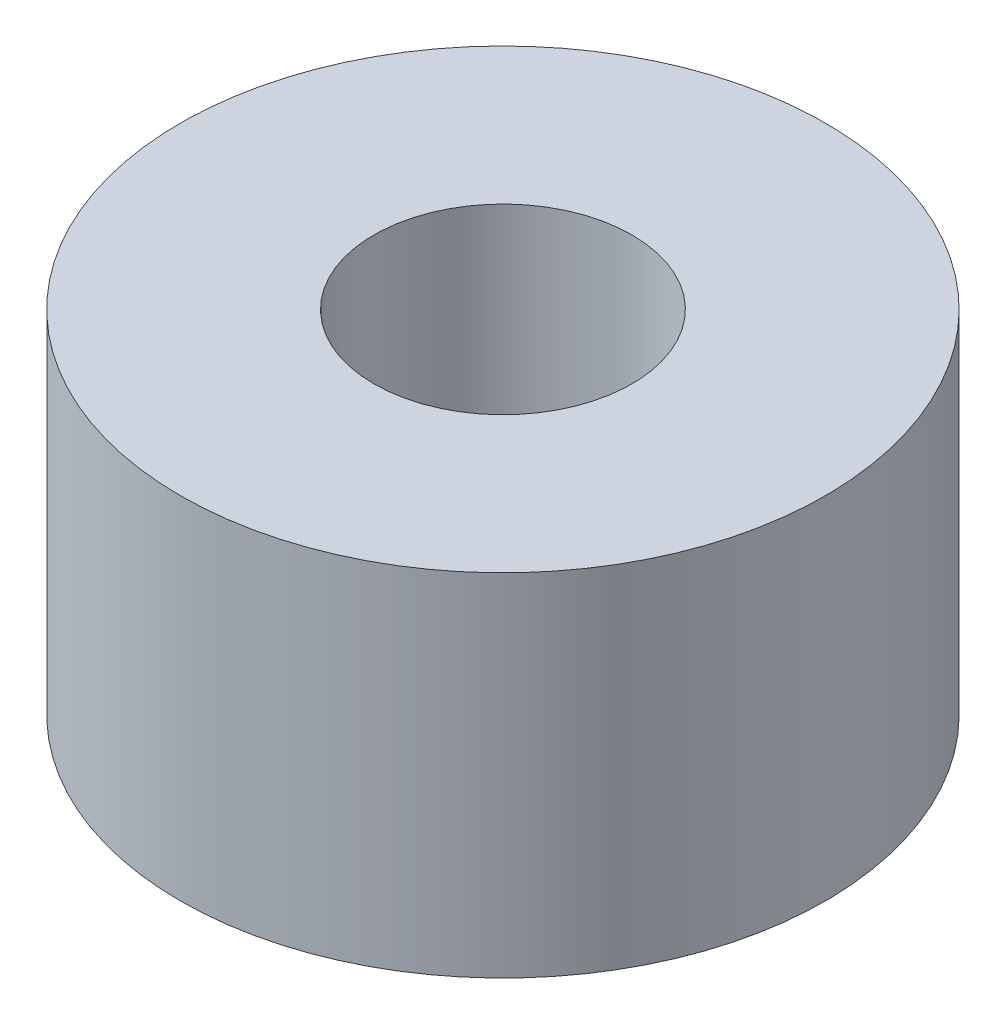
ISO-10303-21;
HEADER;
FILE_DESCRIPTION(('STEP AP214'),'2;1');
FILE_NAME('part.step','',(''),(''),'','','');
FILE_SCHEMA(('AUTOMOTIVE_DESIGN { 1 0 10303 214 1 1 1 1 }'));
ENDSEC;
DATA;
#1=APPLICATION_CONTEXT('core data for automotive mechanical design processes');
#2=APPLICATION_PROTOCOL_DEFINITION('international standard','automotive_design',2000,#1);
#3=PRODUCT_CONTEXT('',#1,'mechanical');
#4=PRODUCT('Part','Part','',(#3));
#5=PRODUCT_RELATED_PRODUCT_CATEGORY('part','',(#4));
#6=PRODUCT_DEFINITION_FORMATION('','',#4);
#7=PRODUCT_DEFINITION_CONTEXT('part definition',#1,'design');
#8=PRODUCT_DEFINITION('design','',#6,#7);
#9=PRODUCT_DEFINITION_SHAPE('','',#8);
#10=(LENGTH_UNIT() NAMED_UNIT(*) SI_UNIT(.MILLI.,.METRE.));
#11=(NAMED_UNIT(*) PLANE_ANGLE_UNIT() SI_UNIT($,.RADIAN.));
#12=(NAMED_UNIT(*) SI_UNIT($,.STERADIAN.) SOLID_ANGLE_UNIT());
#13=UNCERTAINTY_MEASURE_WITH_UNIT(LENGTH_MEASURE(1.E-05),#10,'distance_accuracy_value','');
#14=(GEOMETRIC_REPRESENTATION_CONTEXT(3) GLOBAL_UNCERTAINTY_ASSIGNED_CONTEXT((#13)) GLOBAL_UNIT_ASSIGNED_CONTEXT((#10,
#11,#12)) REPRESENTATION_CONTEXT('',''));
#15=CARTESIAN_POINT('',(0.,0.,0.));
#16=DIRECTION('',(0.,0.,1.));
#17=DIRECTION('',(1.,0.,0.));
#18=AXIS2_PLACEMENT_3D('',#15,#16,#17);
#19=CARTESIAN_POINT('',(0.,8.636,0.));
#20=DIRECTION('',(0.,1.,0.));
#21=DIRECTION('',(0.,0.,1.));
#22=AXIS2_PLACEMENT_3D('',#19,#20,#21);
#23=PLANE('',#22);
#24=CARTESIAN_POINT('',(0.,8.636,0.));
#25=DIRECTION('',(0.,1.,0.));
#26=DIRECTION('',(0.,0.,1.));
#27=AXIS2_PLACEMENT_3D('',#24,#25,#26);
#28=CIRCLE('',#27,7.9375);
#29=CARTESIAN_POINT('',(0.,8.636,7.9375));
#30=VERTEX_POINT('',#29);
#31=EDGE_CURVE('E10',#30,#30,#28,.T.);
#32=ORIENTED_EDGE('',*,*,#31,.T.);
#33=EDGE_LOOP('',(#32));
#34=FACE_BOUND('',#33,.T.);
#35=CARTESIAN_POINT('',(0.,8.636,0.));
#36=DIRECTION('',(0.,1.,0.));
#37=DIRECTION('',(0.,0.,1.));
#38=AXIS2_PLACEMENT_3D('',#35,#36,#37);
#39=CIRCLE('',#38,3.175);
#40=CARTESIAN_POINT('',(0.,8.636,3.175));
#41=VERTEX_POINT('',#40);
#42=EDGE_CURVE('E41',#41,#41,#39,.T.);
#43=ORIENTED_EDGE('',*,*,#42,.F.);
#44=EDGE_LOOP('',(#43));
#45=FACE_BOUND('',#44,.T.);
#46=ADVANCED_FACE('F30',(#34,#45),#23,.T.);
#47=CARTESIAN_POINT('',(0.,0.,0.));
#48=DIRECTION('',(0.,1.,0.));
#49=DIRECTION('',(0.,0.,1.));
#50=AXIS2_PLACEMENT_3D('',#47,#48,#49);
#51=PLANE('',#50);
#52=CARTESIAN_POINT('',(0.,0.,0.));
#53=DIRECTION('',(0.,1.,0.));
#54=DIRECTION('',(0.,0.,1.));
#55=AXIS2_PLACEMENT_3D('',#52,#53,#54);
#56=CIRCLE('',#55,7.9375);
#57=CARTESIAN_POINT('',(0.,0.,7.9375));
#58=VERTEX_POINT('',#57);
#59=EDGE_CURVE('E34',#58,#58,#56,.T.);
#60=ORIENTED_EDGE('',*,*,#59,.F.);
#61=EDGE_LOOP('',(#60));
#62=FACE_BOUND('',#61,.T.);
#63=CARTESIAN_POINT('',(0.,0.,0.));
#64=DIRECTION('',(0.,1.,0.));
#65=DIRECTION('',(0.,0.,1.));
#66=AXIS2_PLACEMENT_3D('',#63,#64,#65);
#67=CIRCLE('',#66,3.175);
#68=CARTESIAN_POINT('',(0.,0.,3.175));
#69=VERTEX_POINT('',#68);
#70=EDGE_CURVE('E43',#69,#69,#67,.T.);
#71=ORIENTED_EDGE('',*,*,#70,.T.);
#72=EDGE_LOOP('',(#71));
#73=FACE_BOUND('',#72,.T.);
#74=ADVANCED_FACE('F53',(#62,#73),#51,.F.);
#75=CARTESIAN_POINT('',(0.,8.636,0.));
#76=DIRECTION('',(0.,-1.,0.));
#77=DIRECTION('',(0.,0.,-1.));
#78=AXIS2_PLACEMENT_3D('',#75,#76,#77);
#79=CYLINDRICAL_SURFACE('',#78,7.9375);
#80=ORIENTED_EDGE('',*,*,#31,.F.);
#81=EDGE_LOOP('',(#80));
#82=FACE_BOUND('',#81,.T.);
#83=ORIENTED_EDGE('',*,*,#59,.T.);
#84=EDGE_LOOP('',(#83));
#85=FACE_BOUND('',#84,.T.);
#86=ADVANCED_FACE('F32',(#82,#85),#79,.T.);
#87=CARTESIAN_POINT('',(0.,8.636,0.));
#88=DIRECTION('',(0.,-1.,0.));
#89=DIRECTION('',(0.,0.,-1.));
#90=AXIS2_PLACEMENT_3D('',#87,#88,#89);
#91=CYLINDRICAL_SURFACE('',#90,3.175);
#92=ORIENTED_EDGE('',*,*,#42,.T.);
#93=EDGE_LOOP('',(#92));
#94=FACE_BOUND('',#93,.T.);
#95=ORIENTED_EDGE('',*,*,#70,.F.);
#96=EDGE_LOOP('',(#95));
#97=FACE_BOUND('',#96,.T.);
#98=ADVANCED_FACE('F49',(#94,#97),#91,.F.);
#99=CLOSED_SHELL('',(#46,#74,#86,#98));
#100=MANIFOLD_SOLID_BREP('B2',#99);
#101=ADVANCED_BREP_SHAPE_REPRESENTATION('',(#18,#100),#14);
#102=SHAPE_DEFINITION_REPRESENTATION(#9,#101);
ENDSEC;
END-ISO-10303-21;
